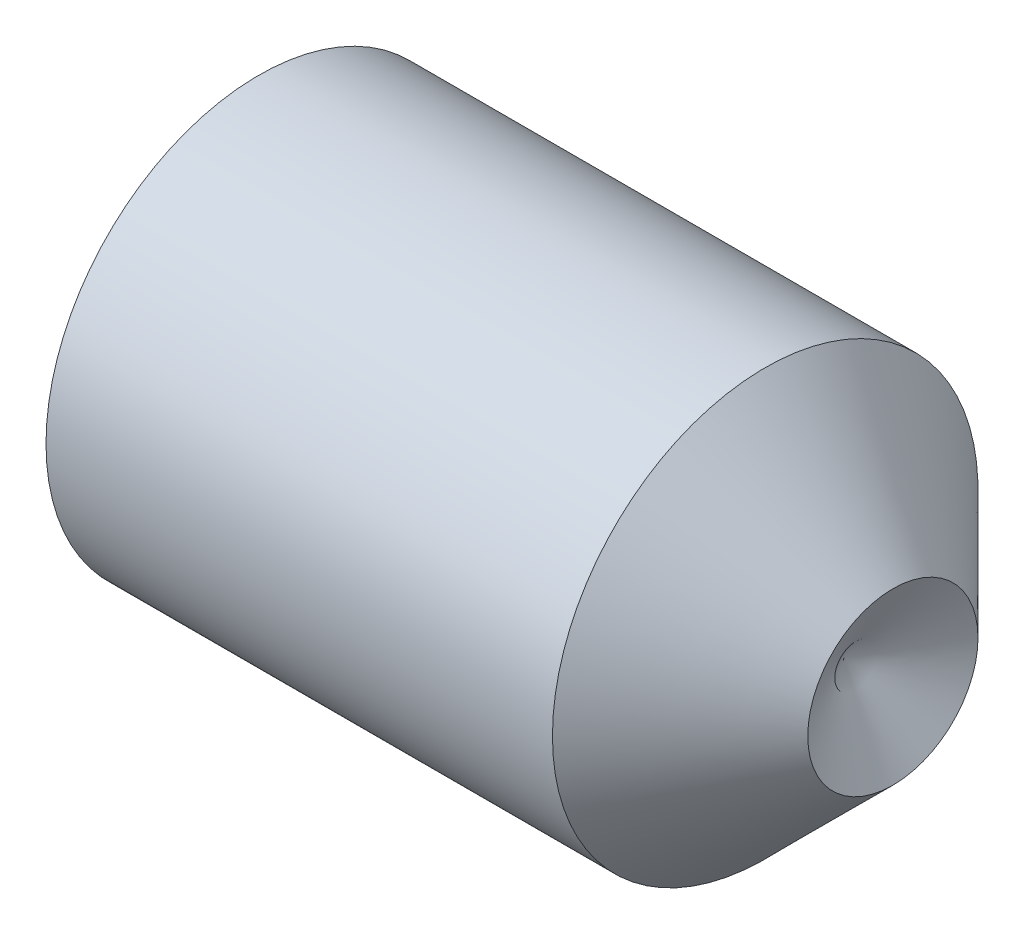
ISO-10303-21;
HEADER;
FILE_DESCRIPTION(('STEP AP214'),'2;1');
FILE_NAME('part.step','',(''),(''),'','','');
FILE_SCHEMA(('AUTOMOTIVE_DESIGN { 1 0 10303 214 1 1 1 1 }'));
ENDSEC;
DATA;
#1=APPLICATION_CONTEXT('core data for automotive mechanical design processes');
#2=APPLICATION_PROTOCOL_DEFINITION('international standard','automotive_design',2000,#1);
#3=PRODUCT_CONTEXT('',#1,'mechanical');
#4=PRODUCT('Part','Part','',(#3));
#5=PRODUCT_RELATED_PRODUCT_CATEGORY('part','',(#4));
#6=PRODUCT_DEFINITION_FORMATION('','',#4);
#7=PRODUCT_DEFINITION_CONTEXT('part definition',#1,'design');
#8=PRODUCT_DEFINITION('design','',#6,#7);
#9=PRODUCT_DEFINITION_SHAPE('','',#8);
#10=(LENGTH_UNIT() NAMED_UNIT(*) SI_UNIT(.MILLI.,.METRE.));
#11=(NAMED_UNIT(*) PLANE_ANGLE_UNIT() SI_UNIT($,.RADIAN.));
#12=(NAMED_UNIT(*) SI_UNIT($,.STERADIAN.) SOLID_ANGLE_UNIT());
#13=UNCERTAINTY_MEASURE_WITH_UNIT(LENGTH_MEASURE(1.E-05),#10,'distance_accuracy_value','');
#14=(GEOMETRIC_REPRESENTATION_CONTEXT(3) GLOBAL_UNCERTAINTY_ASSIGNED_CONTEXT((#13)) GLOBAL_UNIT_ASSIGNED_CONTEXT((#10,
#11,#12)) REPRESENTATION_CONTEXT('',''));
#15=CARTESIAN_POINT('',(0.,0.,0.));
#16=DIRECTION('',(0.,0.,1.));
#17=DIRECTION('',(1.,0.,0.));
#18=AXIS2_PLACEMENT_3D('',#15,#16,#17);
#19=CARTESIAN_POINT('',(0.,0.,0.));
#20=DIRECTION('',(-1.,0.,0.));
#21=DIRECTION('',(0.,0.,1.));
#22=AXIS2_PLACEMENT_3D('',#19,#20,#21);
#23=PLANE('',#22);
#24=CARTESIAN_POINT('',(0.,0.,0.));
#25=DIRECTION('',(-1.,0.,0.));
#26=DIRECTION('',(0.,0.,1.));
#27=AXIS2_PLACEMENT_3D('',#24,#25,#26);
#28=CIRCLE('',#27,0.774);
#29=CARTESIAN_POINT('',(0.,0.,0.774));
#30=VERTEX_POINT('',#29);
#31=EDGE_CURVE('E11',#30,#30,#28,.T.);
#32=ORIENTED_EDGE('',*,*,#31,.T.);
#33=EDGE_LOOP('',(#32));
#34=FACE_BOUND('',#33,.T.);
#35=DIRECTION('',(0.,0.,-1.));
#36=VECTOR('',#35,1.);
#37=CARTESIAN_POINT('',(0.,0.450000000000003,0.259807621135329));
#38=LINE('',#37,#36);
#39=CARTESIAN_POINT('',(0.,0.450000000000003,0.259807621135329));
#40=VERTEX_POINT('',#39);
#41=CARTESIAN_POINT('',(0.,0.450000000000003,-0.259807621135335));
#42=VERTEX_POINT('',#41);
#43=EDGE_CURVE('E98',#40,#42,#38,.T.);
#44=ORIENTED_EDGE('',*,*,#43,.F.);
#45=DIRECTION('',(0.,-0.866025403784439,0.5));
#46=VECTOR('',#45,1.);
#47=CARTESIAN_POINT('',(0.,0.450000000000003,0.259807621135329));
#48=LINE('',#47,#46);
#49=CARTESIAN_POINT('',(0.,0.,0.51961524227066));
#50=VERTEX_POINT('',#49);
#51=EDGE_CURVE('E40',#40,#50,#48,.T.);
#52=ORIENTED_EDGE('',*,*,#51,.T.);
#53=DIRECTION('',(0.,0.866025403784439,0.5));
#54=VECTOR('',#53,1.);
#55=CARTESIAN_POINT('',(0.,-0.449999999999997,0.259807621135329));
#56=LINE('',#55,#54);
#57=CARTESIAN_POINT('',(0.,-0.449999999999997,0.259807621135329));
#58=VERTEX_POINT('',#57);
#59=EDGE_CURVE('E88',#58,#50,#56,.T.);
#60=ORIENTED_EDGE('',*,*,#59,.F.);
#61=DIRECTION('',(0.,0.,-1.));
#62=VECTOR('',#61,1.);
#63=CARTESIAN_POINT('',(0.,-0.449999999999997,0.259807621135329));
#64=LINE('',#63,#62);
#65=CARTESIAN_POINT('',(0.,-0.449999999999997,-0.259807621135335));
#66=VERTEX_POINT('',#65);
#67=EDGE_CURVE('E93',#58,#66,#64,.T.);
#68=ORIENTED_EDGE('',*,*,#67,.T.);
#69=DIRECTION('',(0.,0.866025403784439,-0.5));
#70=VECTOR('',#69,1.);
#71=CARTESIAN_POINT('',(0.,-0.449999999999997,-0.259807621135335));
#72=LINE('',#71,#70);
#73=CARTESIAN_POINT('',(0.,0.,-0.519615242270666));
#74=VERTEX_POINT('',#73);
#75=EDGE_CURVE('E102',#66,#74,#72,.T.);
#76=ORIENTED_EDGE('',*,*,#75,.T.);
#77=DIRECTION('',(0.,-0.866025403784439,-0.5));
#78=VECTOR('',#77,1.);
#79=CARTESIAN_POINT('',(0.,0.450000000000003,-0.259807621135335));
#80=LINE('',#79,#78);
#81=EDGE_CURVE('E105',#42,#74,#80,.T.);
#82=ORIENTED_EDGE('',*,*,#81,.F.);
#83=EDGE_LOOP('',(#44,#52,#60,#68,#76,#82));
#84=FACE_BOUND('',#83,.T.);
#85=ADVANCED_FACE('F26',(#34,#84),#23,.T.);
#86=CARTESIAN_POINT('',(0.,0.,0.));
#87=DIRECTION('',(1.,0.,0.));
#88=DIRECTION('',(0.,0.,-1.));
#89=AXIS2_PLACEMENT_3D('',#86,#87,#88);
#90=CONICAL_SURFACE('',#89,0.774,1.04719755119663);
#91=CARTESIAN_POINT('',(0.274818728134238,0.,0.));
#92=DIRECTION('',(-1.,0.,0.));
#93=DIRECTION('',(0.,0.,1.));
#94=AXIS2_PLACEMENT_3D('',#91,#92,#93);
#95=CIRCLE('',#94,1.25);
#96=CARTESIAN_POINT('',(0.274818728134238,0.,1.25));
#97=VERTEX_POINT('',#96);
#98=EDGE_CURVE('E33',#97,#97,#95,.T.);
#99=ORIENTED_EDGE('',*,*,#98,.T.);
#100=EDGE_LOOP('',(#99));
#101=FACE_BOUND('',#100,.T.);
#102=ORIENTED_EDGE('',*,*,#31,.F.);
#103=EDGE_LOOP('',(#102));
#104=FACE_BOUND('',#103,.T.);
#105=ADVANCED_FACE('F138',(#101,#104),#90,.T.);
#106=CARTESIAN_POINT('',(-12.7,0.,0.));
#107=DIRECTION('',(-1.,0.,0.));
#108=DIRECTION('',(0.,0.,1.));
#109=AXIS2_PLACEMENT_3D('',#106,#107,#108);
#110=CYLINDRICAL_SURFACE('',#109,1.25);
#111=CARTESIAN_POINT('',(3.25,0.,0.));
#112=DIRECTION('',(-1.,0.,0.));
#113=DIRECTION('',(0.,0.,1.));
#114=AXIS2_PLACEMENT_3D('',#111,#112,#113);
#115=CIRCLE('',#114,1.25);
#116=CARTESIAN_POINT('',(3.25,0.,1.25));
#117=VERTEX_POINT('',#116);
#118=EDGE_CURVE('E133',#117,#117,#115,.T.);
#119=ORIENTED_EDGE('',*,*,#118,.T.);
#120=EDGE_LOOP('',(#119));
#121=FACE_BOUND('',#120,.T.);
#122=ORIENTED_EDGE('',*,*,#98,.F.);
#123=EDGE_LOOP('',(#122));
#124=FACE_BOUND('',#123,.T.);
#125=ADVANCED_FACE('F141',(#121,#124),#110,.T.);
#126=CARTESIAN_POINT('',(3.25,0.,0.));
#127=DIRECTION('',(-1.,0.,0.));
#128=DIRECTION('',(0.,0.,1.));
#129=AXIS2_PLACEMENT_3D('',#126,#127,#128);
#130=CONICAL_SURFACE('',#129,1.25,0.785398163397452);
#131=CARTESIAN_POINT('',(4.,0.,0.));
#132=DIRECTION('',(-1.,0.,0.));
#133=DIRECTION('',(0.,0.,1.));
#134=AXIS2_PLACEMENT_3D('',#131,#132,#133);
#135=CIRCLE('',#134,0.5);
#136=CARTESIAN_POINT('',(4.,0.,0.5));
#137=VERTEX_POINT('',#136);
#138=EDGE_CURVE('E84',#137,#137,#135,.T.);
#139=ORIENTED_EDGE('',*,*,#138,.T.);
#140=EDGE_LOOP('',(#139));
#141=FACE_BOUND('',#140,.T.);
#142=ORIENTED_EDGE('',*,*,#118,.F.);
#143=EDGE_LOOP('',(#142));
#144=FACE_BOUND('',#143,.T.);
#145=ADVANCED_FACE('F143',(#141,#144),#130,.T.);
#146=CARTESIAN_POINT('',(3.71132486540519,0.,0.));
#147=DIRECTION('',(1.,0.,0.));
#148=DIRECTION('',(0.,0.,-1.));
#149=AXIS2_PLACEMENT_3D('',#146,#147,#148);
#150=CONICAL_SURFACE('',#149,0.,1.0471975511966);
#151=ORIENTED_EDGE('',*,*,#138,.F.);
#152=EDGE_LOOP('',(#151));
#153=FACE_BOUND('',#152,.T.);
#154=CARTESIAN_POINT('',(3.71132486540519,0.,0.));
#155=VERTEX_POINT('',#154);
#156=VERTEX_LOOP('',#155);
#157=FACE_BOUND('',#156,.T.);
#158=ADVANCED_FACE('F150',(#153,#157),#150,.F.);
#159=CARTESIAN_POINT('',(1.7,0.450000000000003,0.259807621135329));
#160=DIRECTION('',(0.,-0.5,-0.866025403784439));
#161=DIRECTION('',(0.,0.866025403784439,-0.5));
#162=AXIS2_PLACEMENT_3D('',#159,#160,#161);
#163=PLANE('',#162);
#164=ORIENTED_EDGE('',*,*,#51,.F.);
#165=DIRECTION('',(-1.,0.,0.));
#166=VECTOR('',#165,1.);
#167=CARTESIAN_POINT('',(1.7,0.450000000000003,0.259807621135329));
#168=LINE('',#167,#166);
#169=CARTESIAN_POINT('',(1.7,0.450000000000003,0.259807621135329));
#170=VERTEX_POINT('',#169);
#171=EDGE_CURVE('E122',#170,#40,#168,.T.);
#172=ORIENTED_EDGE('',*,*,#171,.F.);
#173=DIRECTION('',(0.,-0.866025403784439,0.5));
#174=VECTOR('',#173,1.);
#175=CARTESIAN_POINT('',(1.7,0.450000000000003,0.259807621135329));
#176=LINE('',#175,#174);
#177=CARTESIAN_POINT('',(1.7,0.,0.51961524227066));
#178=VERTEX_POINT('',#177);
#179=EDGE_CURVE('E80',#170,#178,#176,.T.);
#180=ORIENTED_EDGE('',*,*,#179,.T.);
#181=DIRECTION('',(-1.,0.,0.));
#182=VECTOR('',#181,1.);
#183=CARTESIAN_POINT('',(1.7,0.,0.51961524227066));
#184=LINE('',#183,#182);
#185=EDGE_CURVE('E76',#178,#50,#184,.T.);
#186=ORIENTED_EDGE('',*,*,#185,.T.);
#187=EDGE_LOOP('',(#164,#172,#180,#186));
#188=FACE_BOUND('',#187,.T.);
#189=ADVANCED_FACE('F78',(#188),#163,.T.);
#190=CARTESIAN_POINT('',(1.7,-0.449999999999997,0.259807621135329));
#191=DIRECTION('',(0.,-0.5,0.866025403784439));
#192=DIRECTION('',(0.,-0.866025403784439,-0.5));
#193=AXIS2_PLACEMENT_3D('',#190,#191,#192);
#194=PLANE('',#193);
#195=ORIENTED_EDGE('',*,*,#59,.T.);
#196=ORIENTED_EDGE('',*,*,#185,.F.);
#197=DIRECTION('',(0.,0.866025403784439,0.5));
#198=VECTOR('',#197,1.);
#199=CARTESIAN_POINT('',(1.7,-0.449999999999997,0.259807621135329));
#200=LINE('',#199,#198);
#201=CARTESIAN_POINT('',(1.7,-0.449999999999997,0.259807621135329));
#202=VERTEX_POINT('',#201);
#203=EDGE_CURVE('E110',#202,#178,#200,.T.);
#204=ORIENTED_EDGE('',*,*,#203,.F.);
#205=DIRECTION('',(-1.,0.,0.));
#206=VECTOR('',#205,1.);
#207=CARTESIAN_POINT('',(1.7,-0.449999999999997,0.259807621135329));
#208=LINE('',#207,#206);
#209=EDGE_CURVE('E85',#202,#58,#208,.T.);
#210=ORIENTED_EDGE('',*,*,#209,.T.);
#211=EDGE_LOOP('',(#195,#196,#204,#210));
#212=FACE_BOUND('',#211,.T.);
#213=ADVANCED_FACE('F89',(#212),#194,.F.);
#214=CARTESIAN_POINT('',(1.7,-0.449999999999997,0.259807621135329));
#215=DIRECTION('',(0.,1.,0.));
#216=DIRECTION('',(0.,0.,1.));
#217=AXIS2_PLACEMENT_3D('',#214,#215,#216);
#218=PLANE('',#217);
#219=ORIENTED_EDGE('',*,*,#67,.F.);
#220=ORIENTED_EDGE('',*,*,#209,.F.);
#221=DIRECTION('',(0.,0.,-1.));
#222=VECTOR('',#221,1.);
#223=CARTESIAN_POINT('',(1.7,-0.449999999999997,0.259807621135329));
#224=LINE('',#223,#222);
#225=CARTESIAN_POINT('',(1.7,-0.449999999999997,-0.259807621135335));
#226=VERTEX_POINT('',#225);
#227=EDGE_CURVE('E112',#202,#226,#224,.T.);
#228=ORIENTED_EDGE('',*,*,#227,.T.);
#229=DIRECTION('',(-1.,0.,0.));
#230=VECTOR('',#229,1.);
#231=CARTESIAN_POINT('',(1.7,-0.449999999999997,-0.259807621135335));
#232=LINE('',#231,#230);
#233=EDGE_CURVE('E128',#226,#66,#232,.T.);
#234=ORIENTED_EDGE('',*,*,#233,.T.);
#235=EDGE_LOOP('',(#219,#220,#228,#234));
#236=FACE_BOUND('',#235,.T.);
#237=ADVANCED_FACE('F173',(#236),#218,.T.);
#238=CARTESIAN_POINT('',(1.7,-0.449999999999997,-0.259807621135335));
#239=DIRECTION('',(0.,0.5,0.866025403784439));
#240=DIRECTION('',(0.,-0.866025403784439,0.5));
#241=AXIS2_PLACEMENT_3D('',#238,#239,#240);
#242=PLANE('',#241);
#243=ORIENTED_EDGE('',*,*,#75,.F.);
#244=ORIENTED_EDGE('',*,*,#233,.F.);
#245=DIRECTION('',(0.,0.866025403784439,-0.5));
#246=VECTOR('',#245,1.);
#247=CARTESIAN_POINT('',(1.7,-0.449999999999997,-0.259807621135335));
#248=LINE('',#247,#246);
#249=CARTESIAN_POINT('',(1.7,0.,-0.519615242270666));
#250=VERTEX_POINT('',#249);
#251=EDGE_CURVE('E114',#226,#250,#248,.T.);
#252=ORIENTED_EDGE('',*,*,#251,.T.);
#253=DIRECTION('',(-1.,0.,0.));
#254=VECTOR('',#253,1.);
#255=CARTESIAN_POINT('',(1.7,0.,-0.519615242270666));
#256=LINE('',#255,#254);
#257=EDGE_CURVE('E126',#250,#74,#256,.T.);
#258=ORIENTED_EDGE('',*,*,#257,.T.);
#259=EDGE_LOOP('',(#243,#244,#252,#258));
#260=FACE_BOUND('',#259,.T.);
#261=ADVANCED_FACE('F180',(#260),#242,.T.);
#262=CARTESIAN_POINT('',(1.7,0.450000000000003,-0.259807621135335));
#263=DIRECTION('',(0.,0.5,-0.866025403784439));
#264=DIRECTION('',(0.,0.866025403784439,0.5));
#265=AXIS2_PLACEMENT_3D('',#262,#263,#264);
#266=PLANE('',#265);
#267=ORIENTED_EDGE('',*,*,#81,.T.);
#268=ORIENTED_EDGE('',*,*,#257,.F.);
#269=DIRECTION('',(0.,-0.866025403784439,-0.5));
#270=VECTOR('',#269,1.);
#271=CARTESIAN_POINT('',(1.7,0.450000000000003,-0.259807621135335));
#272=LINE('',#271,#270);
#273=CARTESIAN_POINT('',(1.7,0.450000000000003,-0.259807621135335));
#274=VERTEX_POINT('',#273);
#275=EDGE_CURVE('E116',#274,#250,#272,.T.);
#276=ORIENTED_EDGE('',*,*,#275,.F.);
#277=DIRECTION('',(-1.,0.,0.));
#278=VECTOR('',#277,1.);
#279=CARTESIAN_POINT('',(1.7,0.450000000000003,-0.259807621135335));
#280=LINE('',#279,#278);
#281=EDGE_CURVE('E124',#274,#42,#280,.T.);
#282=ORIENTED_EDGE('',*,*,#281,.T.);
#283=EDGE_LOOP('',(#267,#268,#276,#282));
#284=FACE_BOUND('',#283,.T.);
#285=ADVANCED_FACE('F188',(#284),#266,.F.);
#286=CARTESIAN_POINT('',(1.7,0.450000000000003,0.259807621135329));
#287=DIRECTION('',(0.,1.,0.));
#288=DIRECTION('',(0.,0.,1.));
#289=AXIS2_PLACEMENT_3D('',#286,#287,#288);
#290=PLANE('',#289);
#291=ORIENTED_EDGE('',*,*,#43,.T.);
#292=ORIENTED_EDGE('',*,*,#281,.F.);
#293=DIRECTION('',(0.,0.,-1.));
#294=VECTOR('',#293,1.);
#295=CARTESIAN_POINT('',(1.7,0.450000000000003,0.259807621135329));
#296=LINE('',#295,#294);
#297=EDGE_CURVE('E119',#170,#274,#296,.T.);
#298=ORIENTED_EDGE('',*,*,#297,.F.);
#299=ORIENTED_EDGE('',*,*,#171,.T.);
#300=EDGE_LOOP('',(#291,#292,#298,#299));
#301=FACE_BOUND('',#300,.T.);
#302=ADVANCED_FACE('F196',(#301),#290,.F.);
#303=CARTESIAN_POINT('',(1.7,-0.449999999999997,0.779422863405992));
#304=DIRECTION('',(1.,0.,0.));
#305=DIRECTION('',(0.,0.,-1.));
#306=AXIS2_PLACEMENT_3D('',#303,#304,#305);
#307=PLANE('',#306);
#308=ORIENTED_EDGE('',*,*,#179,.F.);
#309=ORIENTED_EDGE('',*,*,#297,.T.);
#310=ORIENTED_EDGE('',*,*,#275,.T.);
#311=ORIENTED_EDGE('',*,*,#251,.F.);
#312=ORIENTED_EDGE('',*,*,#227,.F.);
#313=ORIENTED_EDGE('',*,*,#203,.T.);
#314=EDGE_LOOP('',(#308,#309,#310,#311,#312,#313));
#315=FACE_BOUND('',#314,.T.);
#316=ADVANCED_FACE('F204',(#315),#307,.F.);
#317=CLOSED_SHELL('',(#85,#105,#125,#145,#158,#189,#213,#237,#261,#285,#302,#316));
#318=MANIFOLD_SOLID_BREP('B2',#317);
#319=ADVANCED_BREP_SHAPE_REPRESENTATION('',(#18,#318),#14);
#320=SHAPE_DEFINITION_REPRESENTATION(#9,#319);
ENDSEC;
END-ISO-10303-21;
